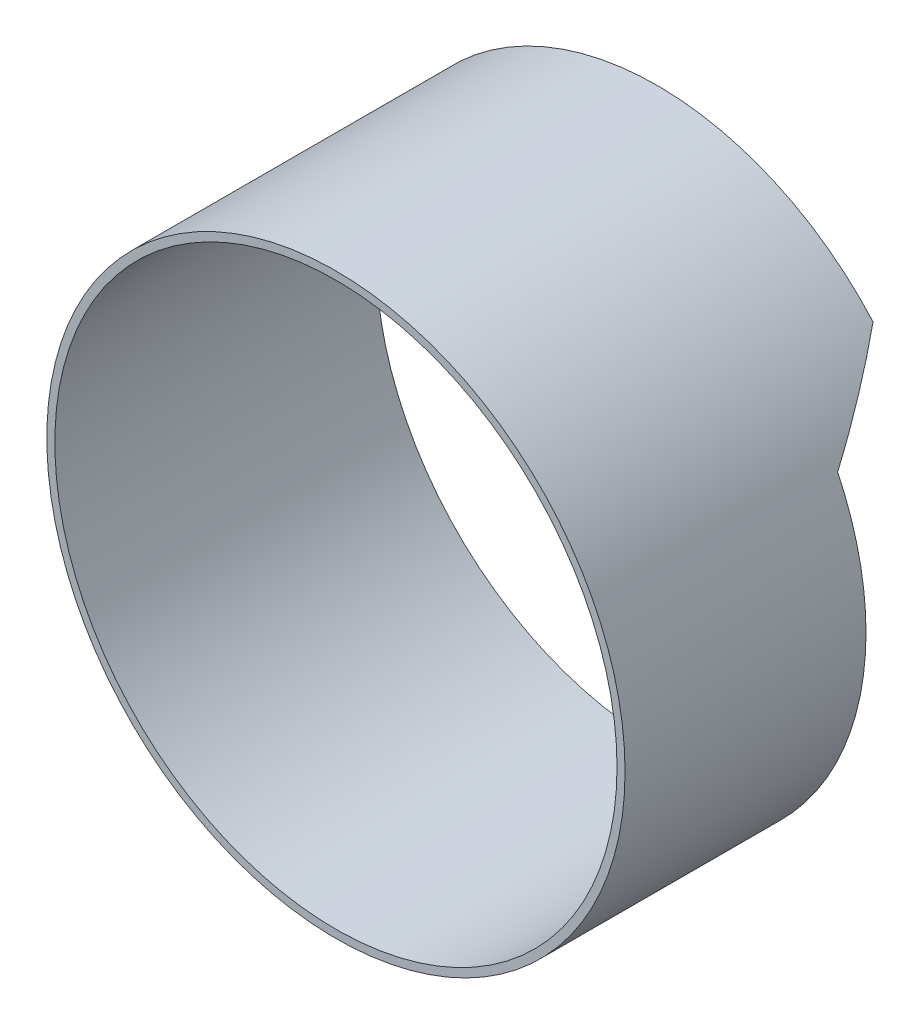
ISO-10303-21;
HEADER;
FILE_DESCRIPTION(('STEP AP214'),'2;1');
FILE_NAME('part.step','',(''),(''),'','','');
FILE_SCHEMA(('AUTOMOTIVE_DESIGN { 1 0 10303 214 1 1 1 1 }'));
ENDSEC;
DATA;
#1=APPLICATION_CONTEXT('core data for automotive mechanical design processes');
#2=APPLICATION_PROTOCOL_DEFINITION('international standard','automotive_design',2000,#1);
#3=PRODUCT_CONTEXT('',#1,'mechanical');
#4=PRODUCT('Part','Part','',(#3));
#5=PRODUCT_RELATED_PRODUCT_CATEGORY('part','',(#4));
#6=PRODUCT_DEFINITION_FORMATION('','',#4);
#7=PRODUCT_DEFINITION_CONTEXT('part definition',#1,'design');
#8=PRODUCT_DEFINITION('design','',#6,#7);
#9=PRODUCT_DEFINITION_SHAPE('','',#8);
#10=(LENGTH_UNIT() NAMED_UNIT(*) SI_UNIT(.MILLI.,.METRE.));
#11=(NAMED_UNIT(*) PLANE_ANGLE_UNIT() SI_UNIT($,.RADIAN.));
#12=(NAMED_UNIT(*) SI_UNIT($,.STERADIAN.) SOLID_ANGLE_UNIT());
#13=UNCERTAINTY_MEASURE_WITH_UNIT(LENGTH_MEASURE(1.E-05),#10,'distance_accuracy_value','');
#14=(GEOMETRIC_REPRESENTATION_CONTEXT(3) GLOBAL_UNCERTAINTY_ASSIGNED_CONTEXT((#13)) GLOBAL_UNIT_ASSIGNED_CONTEXT((#10,
#11,#12)) REPRESENTATION_CONTEXT('',''));
#15=CARTESIAN_POINT('',(0.,0.,0.));
#16=DIRECTION('',(0.,0.,1.));
#17=DIRECTION('',(1.,0.,0.));
#18=AXIS2_PLACEMENT_3D('',#15,#16,#17);
#19=CARTESIAN_POINT('',(9.78840015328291,-55.1832150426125,15.));
#20=DIRECTION('',(0.637784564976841,0.30533727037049,-0.707106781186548));
#21=DIRECTION('',(-0.74256869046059,0.,-0.669769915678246));
#22=AXIS2_PLACEMENT_3D('',#19,#20,#21);
#23=PLANE('',#22);
#24=CARTESIAN_POINT('',(0.,0.,30.0000000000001));
#25=DIRECTION('',(0.637784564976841,0.30533727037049,-0.707106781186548));
#26=DIRECTION('',(0.637784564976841,0.30533727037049,0.707106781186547));
#27=AXIS2_PLACEMENT_3D('',#24,#25,#26);
#28=ELLIPSE('',#27,148.492424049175,105.);
#29=CARTESIAN_POINT('',(16.3913478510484,-103.712697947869,0.));
#30=VERTEX_POINT('',#29);
#31=CARTESIAN_POINT('',(45.3402714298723,-94.7061760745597,30.));
#32=VERTEX_POINT('',#31);
#33=EDGE_CURVE('E20',#30,#32,#28,.F.);
#34=ORIENTED_EDGE('',*,*,#33,.T.);
#35=DIRECTION('',(0.431812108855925,-0.901963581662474,0.));
#36=VECTOR('',#35,1.);
#37=CARTESIAN_POINT('',(45.3402714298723,-94.7061760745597,30.));
#38=LINE('',#37,#36);
#39=CARTESIAN_POINT('',(46.6357077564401,-97.4120668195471,30.));
#40=VERTEX_POINT('',#39);
#41=EDGE_CURVE('E85',#32,#40,#38,.T.);
#42=ORIENTED_EDGE('',*,*,#41,.T.);
#43=CARTESIAN_POINT('',(0.,0.,30.0000000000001));
#44=DIRECTION('',(0.637784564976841,0.30533727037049,-0.707106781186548));
#45=DIRECTION('',(0.637784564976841,0.30533727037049,0.707106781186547));
#46=AXIS2_PLACEMENT_3D('',#43,#44,#45);
#47=ELLIPSE('',#46,152.735064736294,108.);
#48=CARTESIAN_POINT('',(17.7414687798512,-106.532813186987,0.));
#49=VERTEX_POINT('',#48);
#50=EDGE_CURVE('E61',#49,#40,#47,.F.);
#51=ORIENTED_EDGE('',*,*,#50,.F.);
#52=DIRECTION('',(0.431812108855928,-0.901963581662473,0.));
#53=VECTOR('',#52,1.);
#54=CARTESIAN_POINT('',(16.3913478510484,-103.712697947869,0.));
#55=LINE('',#54,#53);
#56=EDGE_CURVE('E56',#30,#49,#55,.T.);
#57=ORIENTED_EDGE('',*,*,#56,.F.);
#58=EDGE_LOOP('',(#34,#42,#51,#57));
#59=FACE_BOUND('',#58,.T.);
#60=ADVANCED_FACE('F16',(#59),#23,.T.);
#61=CARTESIAN_POINT('',(0.,0.,0.));
#62=DIRECTION('',(0.,0.,1.));
#63=DIRECTION('',(1.,0.,0.));
#64=AXIS2_PLACEMENT_3D('',#61,#62,#63);
#65=CYLINDRICAL_SURFACE('',#64,105.);
#66=CARTESIAN_POINT('',(0.,0.,120.));
#67=DIRECTION('',(0.,0.,1.));
#68=DIRECTION('',(1.,0.,0.));
#69=AXIS2_PLACEMENT_3D('',#66,#67,#68);
#70=CIRCLE('',#69,105.);
#71=CARTESIAN_POINT('',(105.,0.,120.));
#72=VERTEX_POINT('',#71);
#73=EDGE_CURVE('E72',#72,#72,#70,.T.);
#74=ORIENTED_EDGE('',*,*,#73,.T.);
#75=EDGE_LOOP('',(#74));
#76=FACE_BOUND('',#75,.T.);
#77=CARTESIAN_POINT('',(0.,0.,30.));
#78=DIRECTION('',(0.,0.,1.));
#79=DIRECTION('',(1.,0.,0.));
#80=AXIS2_PLACEMENT_3D('',#77,#78,#79);
#81=CIRCLE('',#80,105.);
#82=CARTESIAN_POINT('',(94.7061760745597,45.3402714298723,29.9999999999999));
#83=VERTEX_POINT('',#82);
#84=EDGE_CURVE('E71',#83,#32,#81,.F.);
#85=ORIENTED_EDGE('',*,*,#84,.T.);
#86=ORIENTED_EDGE('',*,*,#33,.F.);
#87=CARTESIAN_POINT('',(0.,0.,0.));
#88=DIRECTION('',(0.,0.,1.));
#89=DIRECTION('',(1.,0.,0.));
#90=AXIS2_PLACEMENT_3D('',#87,#88,#89);
#91=CIRCLE('',#90,105.);
#92=CARTESIAN_POINT('',(77.8039714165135,70.5091627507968,0.));
#93=VERTEX_POINT('',#92);
#94=EDGE_CURVE('E70',#93,#30,#91,.T.);
#95=ORIENTED_EDGE('',*,*,#94,.F.);
#96=CARTESIAN_POINT('',(0.,0.,29.9999999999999));
#97=DIRECTION('',(0.30533727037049,-0.637784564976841,-0.707106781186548));
#98=DIRECTION('',(0.30533727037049,-0.637784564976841,0.707106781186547));
#99=AXIS2_PLACEMENT_3D('',#96,#97,#98);
#100=ELLIPSE('',#99,148.492424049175,105.);
#101=EDGE_CURVE('E64',#83,#93,#100,.F.);
#102=ORIENTED_EDGE('',*,*,#101,.F.);
#103=EDGE_LOOP('',(#85,#86,#95,#102));
#104=FACE_BOUND('',#103,.T.);
#105=ADVANCED_FACE('F68',(#76,#104),#65,.F.);
#106=CARTESIAN_POINT('',(0.,0.,120.));
#107=DIRECTION('',(0.,0.,-1.));
#108=DIRECTION('',(-1.,0.,0.));
#109=AXIS2_PLACEMENT_3D('',#106,#107,#108);
#110=PLANE('',#109);
#111=ORIENTED_EDGE('',*,*,#73,.F.);
#112=EDGE_LOOP('',(#111));
#113=FACE_BOUND('',#112,.T.);
#114=CARTESIAN_POINT('',(0.,0.,120.));
#115=DIRECTION('',(0.,0.,1.));
#116=DIRECTION('',(1.,0.,0.));
#117=AXIS2_PLACEMENT_3D('',#114,#115,#116);
#118=CIRCLE('',#117,108.);
#119=CARTESIAN_POINT('',(108.,0.,120.));
#120=VERTEX_POINT('',#119);
#121=EDGE_CURVE('E74',#120,#120,#118,.F.);
#122=ORIENTED_EDGE('',*,*,#121,.F.);
#123=EDGE_LOOP('',(#122));
#124=FACE_BOUND('',#123,.T.);
#125=ADVANCED_FACE('F90',(#113,#124),#110,.F.);
#126=CARTESIAN_POINT('',(88.2060938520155,-31.0923532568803,30.));
#127=DIRECTION('',(0.,0.,1.));
#128=DIRECTION('',(1.,0.,0.));
#129=AXIS2_PLACEMENT_3D('',#126,#127,#128);
#130=PLANE('',#129);
#131=DIRECTION('',(-0.901963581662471,-0.431812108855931,0.));
#132=VECTOR('',#131,1.);
#133=CARTESIAN_POINT('',(97.4120668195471,46.6357077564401,30.));
#134=LINE('',#133,#132);
#135=CARTESIAN_POINT('',(97.4120668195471,46.6357077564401,29.9999999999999));
#136=VERTEX_POINT('',#135);
#137=EDGE_CURVE('E83',#136,#83,#134,.T.);
#138=ORIENTED_EDGE('',*,*,#137,.F.);
#139=CARTESIAN_POINT('',(0.,0.,30.));
#140=DIRECTION('',(0.,0.,1.));
#141=DIRECTION('',(1.,0.,0.));
#142=AXIS2_PLACEMENT_3D('',#139,#140,#141);
#143=CIRCLE('',#142,108.);
#144=EDGE_CURVE('E77',#40,#136,#143,.T.);
#145=ORIENTED_EDGE('',*,*,#144,.F.);
#146=ORIENTED_EDGE('',*,*,#41,.F.);
#147=ORIENTED_EDGE('',*,*,#84,.F.);
#148=EDGE_LOOP('',(#138,#145,#146,#147));
#149=FACE_BOUND('',#148,.T.);
#150=ADVANCED_FACE('F93',(#149),#130,.F.);
#151=CARTESIAN_POINT('',(40.875906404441,36.1995894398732,15.));
#152=DIRECTION('',(0.30533727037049,-0.637784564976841,-0.707106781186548));
#153=DIRECTION('',(0.,0.74256869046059,-0.669769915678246));
#154=AXIS2_PLACEMENT_3D('',#151,#152,#153);
#155=PLANE('',#154);
#156=ORIENTED_EDGE('',*,*,#101,.T.);
#157=DIRECTION('',(-0.901963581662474,-0.431812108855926,0.));
#158=VECTOR('',#157,1.);
#159=CARTESIAN_POINT('',(80.6240866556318,71.8592836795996,0.));
#160=LINE('',#159,#158);
#161=CARTESIAN_POINT('',(80.6240866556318,71.8592836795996,0.));
#162=VERTEX_POINT('',#161);
#163=EDGE_CURVE('E35',#162,#93,#160,.T.);
#164=ORIENTED_EDGE('',*,*,#163,.F.);
#165=CARTESIAN_POINT('',(0.,0.,29.9999999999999));
#166=DIRECTION('',(0.30533727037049,-0.637784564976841,-0.707106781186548));
#167=DIRECTION('',(0.30533727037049,-0.637784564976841,0.707106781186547));
#168=AXIS2_PLACEMENT_3D('',#165,#166,#167);
#169=ELLIPSE('',#168,152.735064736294,108.);
#170=EDGE_CURVE('E26',#136,#162,#169,.F.);
#171=ORIENTED_EDGE('',*,*,#170,.F.);
#172=ORIENTED_EDGE('',*,*,#137,.T.);
#173=EDGE_LOOP('',(#156,#164,#171,#172));
#174=FACE_BOUND('',#173,.T.);
#175=ADVANCED_FACE('F106',(#174),#155,.T.);
#176=CARTESIAN_POINT('',(0.,0.,0.));
#177=DIRECTION('',(0.,0.,-1.));
#178=DIRECTION('',(-1.,0.,0.));
#179=AXIS2_PLACEMENT_3D('',#176,#177,#178);
#180=PLANE('',#179);
#181=ORIENTED_EDGE('',*,*,#163,.T.);
#182=ORIENTED_EDGE('',*,*,#94,.T.);
#183=ORIENTED_EDGE('',*,*,#56,.T.);
#184=CARTESIAN_POINT('',(0.,0.,0.));
#185=DIRECTION('',(0.,0.,1.));
#186=DIRECTION('',(1.,0.,0.));
#187=AXIS2_PLACEMENT_3D('',#184,#185,#186);
#188=CIRCLE('',#187,108.);
#189=EDGE_CURVE('E10',#162,#49,#188,.T.);
#190=ORIENTED_EDGE('',*,*,#189,.F.);
#191=EDGE_LOOP('',(#181,#182,#183,#190));
#192=FACE_BOUND('',#191,.T.);
#193=ADVANCED_FACE('F73',(#192),#180,.T.);
#194=CARTESIAN_POINT('',(0.,0.,0.));
#195=DIRECTION('',(0.,0.,1.));
#196=DIRECTION('',(1.,0.,0.));
#197=AXIS2_PLACEMENT_3D('',#194,#195,#196);
#198=CYLINDRICAL_SURFACE('',#197,108.);
#199=ORIENTED_EDGE('',*,*,#121,.T.);
#200=EDGE_LOOP('',(#199));
#201=FACE_BOUND('',#200,.T.);
#202=ORIENTED_EDGE('',*,*,#170,.T.);
#203=ORIENTED_EDGE('',*,*,#189,.T.);
#204=ORIENTED_EDGE('',*,*,#50,.T.);
#205=ORIENTED_EDGE('',*,*,#144,.T.);
#206=EDGE_LOOP('',(#202,#203,#204,#205));
#207=FACE_BOUND('',#206,.T.);
#208=ADVANCED_FACE('F18',(#201,#207),#198,.T.);
#209=CLOSED_SHELL('',(#60,#105,#125,#150,#175,#193,#208));
#210=MANIFOLD_SOLID_BREP('B1',#209);
#211=ADVANCED_BREP_SHAPE_REPRESENTATION('',(#18,#210),#14);
#212=SHAPE_DEFINITION_REPRESENTATION(#9,#211);
ENDSEC;
END-ISO-10303-21;
